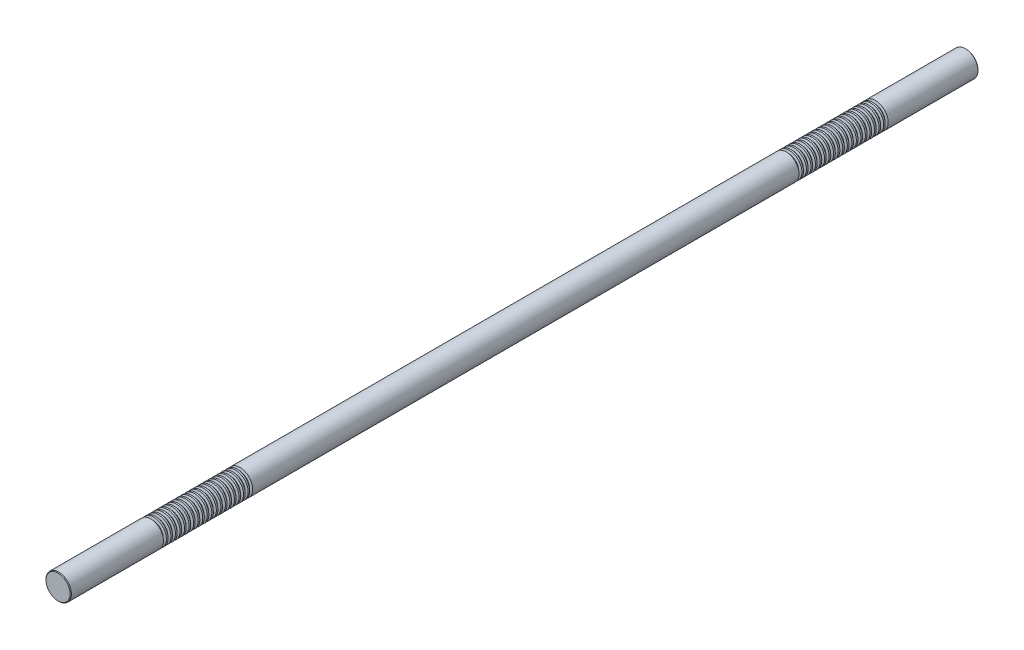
from build123d import *

# Parameters (mm, degrees)
SKETCH1_R           = 14
BOSS_EXTRUDE1_DEPTH = 500
CHAMFER1_SIZE       = 0.7
LPATTERN1_COUNT     = 20
LPATTERN1_PITCH     = 5
LPATTERN2_COUNT     = 2
LPATTERN2_PITCH     = 700


with BuildPart() as part:
    # Sketch1 → Boss-Extrude1 (new, symmetric)
    with BuildSketch(Plane.XY):
        Circle(SKETCH1_R)
    extrude(amount=BOSS_EXTRUDE1_DEPTH, both=True)

    # Chamfer1
    chamfer1_edges = [part.edges().sort_by_distance(p)[0] for p in [
        (-14, 0, -500),
        (-14, 0, 500),
    ]]
    chamfer(chamfer1_edges, length=CHAMFER1_SIZE)

    # Sketch2 → Cut-Revolve1 (revolve, cut)
    with BuildSketch(Plane(origin=(0, 0, 0), x_dir=(0, 0, -1), z_dir=(1, 0, 0)), mode=Mode.PRIVATE) as cut_revolve1_sk:
        Polygon((400.36843014, 14), (397.13156986, 14), (397.86843014, 11.25), (399.63156986, 11.25), align=None)
    cut_revolve1 = revolve(cut_revolve1_sk.sketch.rotate(Axis((0, 0, 500), (0, 0, -1)), 90), axis=Axis((0, 0, 500), (0, 0, -1)), mode=Mode.SUBTRACT)

    # LPattern1: Cut-Revolve1 ×20
    with Locations(*[(0, 0, i * LPATTERN1_PITCH) for i in range(1, LPATTERN1_COUNT)]):
        add(cut_revolve1, mode=Mode.SUBTRACT)

    # LPattern2: Cut-Revolve1 ×2
    with Locations(*[(0, 0, i * LPATTERN2_PITCH) for i in range(1, LPATTERN2_COUNT)]):
        add(cut_revolve1, mode=Mode.SUBTRACT)

    # LPattern2 copy 1 sketch → LPattern2 copy 1 (revolve, cut)
    with BuildSketch(Plane(origin=(0, 0, 705), x_dir=(0, 0, -1), z_dir=(1, 0, 0))):
        Polygon((400.36843014, 14), (397.13156986, 14), (397.86843014, 11.25), (399.63156986, 11.25), align=None)
    revolve(axis=Axis((0, 0, 1205), (0, 0, -1)), mode=Mode.SUBTRACT)

    # LPattern2 copy 2 sketch → LPattern2 copy 2 (revolve, cut)
    with BuildSketch(Plane(origin=(0, 0, 710), x_dir=(0, 0, -1), z_dir=(1, 0, 0))):
        Polygon((400.36843014, 14), (397.13156986, 14), (397.86843014, 11.25), (399.63156986, 11.25), align=None)
    revolve(axis=Axis((0, 0, 1210), (0, 0, -1)), mode=Mode.SUBTRACT)

    # LPattern2 copy 3 sketch → LPattern2 copy 3 (revolve, cut)
    with BuildSketch(Plane(origin=(0, 0, 715), x_dir=(0, 0, -1), z_dir=(1, 0, 0))):
        Polygon((400.36843014, 14), (397.13156986, 14), (397.86843014, 11.25), (399.63156986, 11.25), align=None)
    revolve(axis=Axis((0, 0, 1215), (0, 0, -1)), mode=Mode.SUBTRACT)

    # LPattern2 copy 4 sketch → LPattern2 copy 4 (revolve, cut)
    with BuildSketch(Plane(origin=(0, 0, 720), x_dir=(0, 0, -1), z_dir=(1, 0, 0))):
        Polygon((400.36843014, 14), (397.13156986, 14), (397.86843014, 11.25), (399.63156986, 11.25), align=None)
    revolve(axis=Axis((0, 0, 1220), (0, 0, -1)), mode=Mode.SUBTRACT)

    # LPattern2 copy 5 sketch → LPattern2 copy 5 (revolve, cut)
    with BuildSketch(Plane(origin=(0, 0, 725), x_dir=(0, 0, -1), z_dir=(1, 0, 0))):
        Polygon((400.36843014, 14), (397.13156986, 14), (397.86843014, 11.25), (399.63156986, 11.25), align=None)
    revolve(axis=Axis((0, 0, 1225), (0, 0, -1)), mode=Mode.SUBTRACT)

    # LPattern2 copy 6 sketch → LPattern2 copy 6 (revolve, cut)
    with BuildSketch(Plane(origin=(0, 0, 730), x_dir=(0, 0, -1), z_dir=(1, 0, 0))):
        Polygon((400.36843014, 14), (397.13156986, 14), (397.86843014, 11.25), (399.63156986, 11.25), align=None)
    revolve(axis=Axis((0, 0, 1230), (0, 0, -1)), mode=Mode.SUBTRACT)

    # LPattern2 copy 7 sketch → LPattern2 copy 7 (revolve, cut)
    with BuildSketch(Plane(origin=(0, 0, 735), x_dir=(0, 0, -1), z_dir=(1, 0, 0))):
        Polygon((400.36843014, 14), (397.13156986, 14), (397.86843014, 11.25), (399.63156986, 11.25), align=None)
    revolve(axis=Axis((0, 0, 1235), (0, 0, -1)), mode=Mode.SUBTRACT)

    # LPattern2 copy 8 sketch → LPattern2 copy 8 (revolve, cut)
    with BuildSketch(Plane(origin=(0, 0, 740), x_dir=(0, 0, -1), z_dir=(1, 0, 0))):
        Polygon((400.36843014, 14), (397.13156986, 14), (397.86843014, 11.25), (399.63156986, 11.25), align=None)
    revolve(axis=Axis((0, 0, 1240), (0, 0, -1)), mode=Mode.SUBTRACT)

    # LPattern2 copy 9 sketch → LPattern2 copy 9 (revolve, cut)
    with BuildSketch(Plane(origin=(0, 0, 745), x_dir=(0, 0, -1), z_dir=(1, 0, 0))):
        Polygon((400.36843014, 14), (397.13156986, 14), (397.86843014, 11.25), (399.63156986, 11.25), align=None)
    revolve(axis=Axis((0, 0, 1245), (0, 0, -1)), mode=Mode.SUBTRACT)

    # LPattern2 copy 10 sketch → LPattern2 copy 10 (revolve, cut)
    with BuildSketch(Plane(origin=(0, 0, 750), x_dir=(0, 0, -1), z_dir=(1, 0, 0))):
        Polygon((400.36843014, 14), (397.13156986, 14), (397.86843014, 11.25), (399.63156986, 11.25), align=None)
    revolve(axis=Axis((0, 0, 1250), (0, 0, -1)), mode=Mode.SUBTRACT)

    # LPattern2 copy 11 sketch → LPattern2 copy 11 (revolve, cut)
    with BuildSketch(Plane(origin=(0, 0, 755), x_dir=(0, 0, -1), z_dir=(1, 0, 0))):
        Polygon((400.36843014, 14), (397.13156986, 14), (397.86843014, 11.25), (399.63156986, 11.25), align=None)
    revolve(axis=Axis((0, 0, 1255), (0, 0, -1)), mode=Mode.SUBTRACT)

    # LPattern2 copy 12 sketch → LPattern2 copy 12 (revolve, cut)
    with BuildSketch(Plane(origin=(0, 0, 760), x_dir=(0, 0, -1), z_dir=(1, 0, 0))):
        Polygon((400.36843014, 14), (397.13156986, 14), (397.86843014, 11.25), (399.63156986, 11.25), align=None)
    revolve(axis=Axis((0, 0, 1260), (0, 0, -1)), mode=Mode.SUBTRACT)

    # LPattern2 copy 13 sketch → LPattern2 copy 13 (revolve, cut)
    with BuildSketch(Plane(origin=(0, 0, 765), x_dir=(0, 0, -1), z_dir=(1, 0, 0))):
        Polygon((400.36843014, 14), (397.13156986, 14), (397.86843014, 11.25), (399.63156986, 11.25), align=None)
    revolve(axis=Axis((0, 0, 1265), (0, 0, -1)), mode=Mode.SUBTRACT)

    # LPattern2 copy 14 sketch → LPattern2 copy 14 (revolve, cut)
    with BuildSketch(Plane(origin=(0, 0, 770), x_dir=(0, 0, -1), z_dir=(1, 0, 0))):
        Polygon((400.36843014, 14), (397.13156986, 14), (397.86843014, 11.25), (399.63156986, 11.25), align=None)
    revolve(axis=Axis((0, 0, 1270), (0, 0, -1)), mode=Mode.SUBTRACT)

    # LPattern2 copy 15 sketch → LPattern2 copy 15 (revolve, cut)
    with BuildSketch(Plane(origin=(0, 0, 775), x_dir=(0, 0, -1), z_dir=(1, 0, 0))):
        Polygon((400.36843014, 14), (397.13156986, 14), (397.86843014, 11.25), (399.63156986, 11.25), align=None)
    revolve(axis=Axis((0, 0, 1275), (0, 0, -1)), mode=Mode.SUBTRACT)

    # LPattern2 copy 16 sketch → LPattern2 copy 16 (revolve, cut)
    with BuildSketch(Plane(origin=(0, 0, 780), x_dir=(0, 0, -1), z_dir=(1, 0, 0))):
        Polygon((400.36843014, 14), (397.13156986, 14), (397.86843014, 11.25), (399.63156986, 11.25), align=None)
    revolve(axis=Axis((0, 0, 1280), (0, 0, -1)), mode=Mode.SUBTRACT)

    # LPattern2 copy 17 sketch → LPattern2 copy 17 (revolve, cut)
    with BuildSketch(Plane(origin=(0, 0, 785), x_dir=(0, 0, -1), z_dir=(1, 0, 0))):
        Polygon((400.36843014, 14), (397.13156986, 14), (397.86843014, 11.25), (399.63156986, 11.25), align=None)
    revolve(axis=Axis((0, 0, 1285), (0, 0, -1)), mode=Mode.SUBTRACT)

    # LPattern2 copy 18 sketch → LPattern2 copy 18 (revolve, cut)
    with BuildSketch(Plane(origin=(0, 0, 790), x_dir=(0, 0, -1), z_dir=(1, 0, 0))):
        Polygon((400.36843014, 14), (397.13156986, 14), (397.86843014, 11.25), (399.63156986, 11.25), align=None)
    revolve(axis=Axis((0, 0, 1290), (0, 0, -1)), mode=Mode.SUBTRACT)

    # LPattern2 copy 19 sketch → LPattern2 copy 19 (revolve, cut)
    with BuildSketch(Plane(origin=(0, 0, 795), x_dir=(0, 0, -1), z_dir=(1, 0, 0))):
        Polygon((400.36843014, 14), (397.13156986, 14), (397.86843014, 11.25), (399.63156986, 11.25), align=None)
    revolve(axis=Axis((0, 0, 1295), (0, 0, -1)), mode=Mode.SUBTRACT)


solid = part.part
